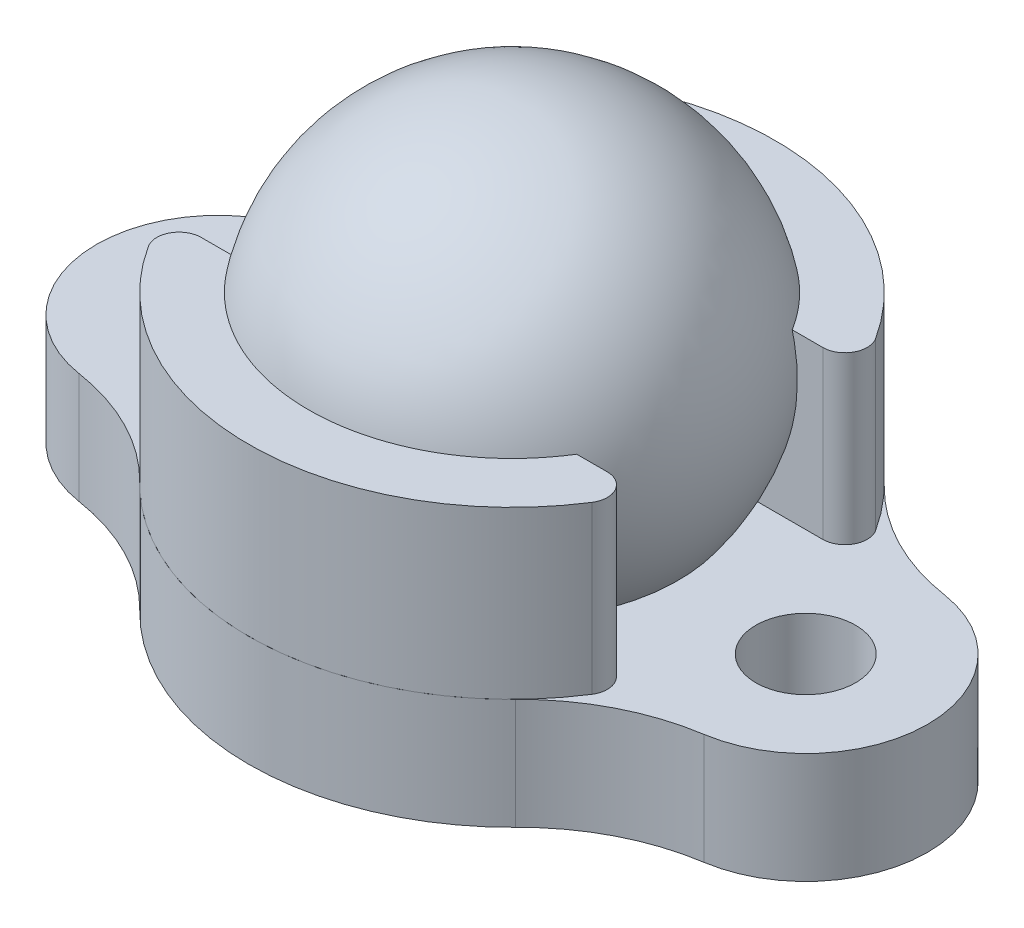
from build123d import *

# Parameters (mm, degrees)
SKETCH1_R           = 1.143
BOSS_EXTRUDE1_DEPTH = 2.54
SKETCH3_R           = 6.0325
BOSS_EXTRUDE2_DEPTH = 3.81
SKETCH4_W           = 12.065
SKETCH4_H           = 4.93838643
CUT_EXTRUDE1_DEPTH  = 3.81
FILLET3_R           = 0.508
FILLET4_R           = 0.508


with BuildPart() as part:
    # Sketch1 → Boss-Extrude1 (new body)
    with BuildSketch(Plane(origin=(0, 0, 0), x_dir=(1, 0, 0), z_dir=(0, 1, 0))):
        with BuildLine():
            ThreePointArc((-7.15751864, 2.761252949), (-9.525, 0), (-7.15751864, -2.761252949))
            ThreePointArc((-7.15751864, -2.761252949), (-5.613614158, -3.26210928), (-4.306489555, -4.224358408))
            ThreePointArc((-4.306489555, -4.224358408), (0, -6.0325), (4.306489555, -4.224358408))
            ThreePointArc((4.306489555, -4.224358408), (5.613614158, -3.26210928), (7.15751864, -2.761252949))
            ThreePointArc((7.15751864, -2.761252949), (9.525, 0), (7.15751864, 2.761252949))
            ThreePointArc((7.15751864, 2.761252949), (5.613614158, 3.26210928), (4.306489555, 4.224358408))
            ThreePointArc((4.306489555, 4.224358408), (0, 6.0325), (-4.306489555, 4.224358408))
            ThreePointArc((-4.306489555, 4.224358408), (-5.613614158, 3.26210928), (-7.15751864, 2.761252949))
        make_face()
        with Locations(Location((-6.731, 0, 0), (0, 0, 270))):
            Circle(SKETCH1_R, mode=Mode.SUBTRACT)
        with Locations(Location((6.731, 0, 0), (0, 0, 270))):
            Circle(SKETCH1_R, mode=Mode.SUBTRACT)
    extrude(amount=BOSS_EXTRUDE1_DEPTH)

    # Sketch2 → Revolve2 (revolve)
    with BuildSketch(Plane.XY):
        with BuildLine():
            Line((0, 10.16), (0, 0.635))
            ThreePointArc((0, 0.635), (4.7625, 5.3975), (0, 10.16))
        make_face()
    revolve(axis=Axis((0, 5.3975, 0), (0, -1, 0)))


with BuildPart() as body_2:
    # Sketch3 → Boss-Extrude2 (new body)
    with BuildSketch(Plane(origin=(0, 2.54, 0), x_dir=(1, 0, 0), z_dir=(0, 1, 0))):
        with Locations(Location((0, 0, 0), (0, 0, 90))):
            Circle(SKETCH3_R)
    extrude(amount=BOSS_EXTRUDE2_DEPTH)

    # Sketch4 → Cut-Extrude1 (cut)
    with BuildSketch(Plane(origin=(0, 6.35, 0), x_dir=(1, 0, 0), z_dir=(0, 1, 0))):
        Rectangle(SKETCH4_W, SKETCH4_H)
    extrude(amount=-CUT_EXTRUDE1_DEPTH, mode=Mode.SUBTRACT)


with BuildPart() as cut_extrude1_piece_1:
    # of the separate pieces the step leaves, piece 1, a body of its own (cut_extrude1_pieces)
    add(body_2.part.solids().sort_by_distance((5.504011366, 2.54, -2.469193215))[0])

    # Fillet3
    fillet3_edges = [cut_extrude1_piece_1.edges().sort_by_distance(p)[0] for p in [
        (-5.504011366, 4.445, -2.469193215),
        (5.504011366, 4.445, -2.469193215),
    ]]
    fillet(fillet3_edges, radius=FILLET3_R)


with BuildPart() as cut_extrude1_piece_2:
    # of the separate pieces the step leaves, piece 2, a body of its own (cut_extrude1_pieces)
    add(body_2.part.solids().sort_by_distance((5.504011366, 2.54, 2.469193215))[0])

    # Fillet4
    fillet4_edges = [cut_extrude1_piece_2.edges().sort_by_distance(p)[0] for p in [
        (-5.504011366, 4.445, 2.469193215),
        (5.504011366, 4.445, 2.469193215),
    ]]
    fillet(fillet4_edges, radius=FILLET4_R)


solid = Compound([part.part, cut_extrude1_piece_1.part, cut_extrude1_piece_2.part])
